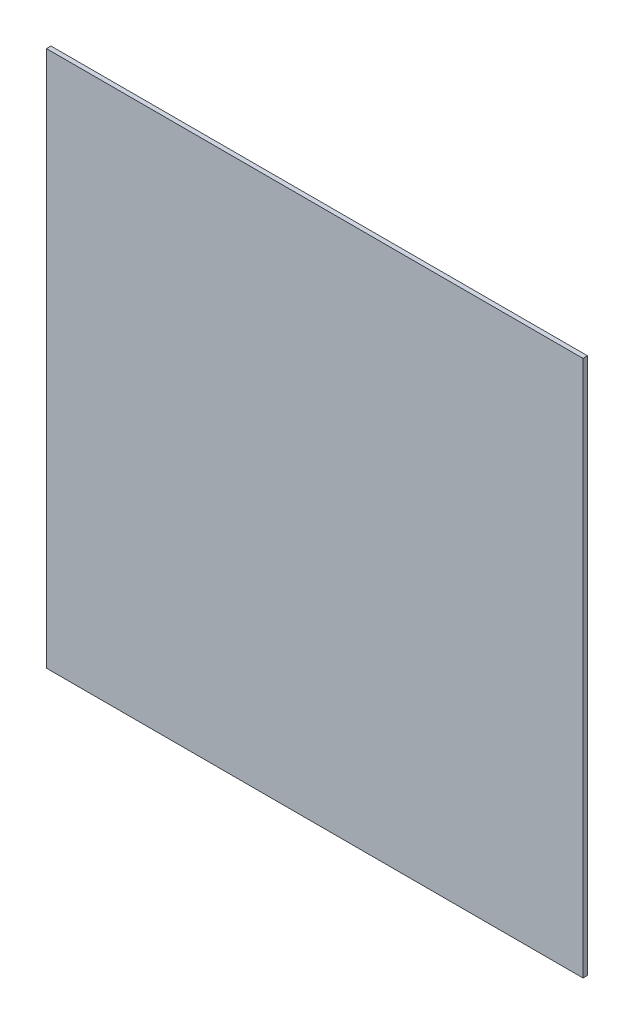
ISO-10303-21;
HEADER;
FILE_DESCRIPTION(('STEP AP214'),'2;1');
FILE_NAME('part.step','',(''),(''),'','','');
FILE_SCHEMA(('AUTOMOTIVE_DESIGN { 1 0 10303 214 1 1 1 1 }'));
ENDSEC;
DATA;
#1=APPLICATION_CONTEXT('core data for automotive mechanical design processes');
#2=APPLICATION_PROTOCOL_DEFINITION('international standard','automotive_design',2000,#1);
#3=PRODUCT_CONTEXT('',#1,'mechanical');
#4=PRODUCT('Part','Part','',(#3));
#5=PRODUCT_RELATED_PRODUCT_CATEGORY('part','',(#4));
#6=PRODUCT_DEFINITION_FORMATION('','',#4);
#7=PRODUCT_DEFINITION_CONTEXT('part definition',#1,'design');
#8=PRODUCT_DEFINITION('design','',#6,#7);
#9=PRODUCT_DEFINITION_SHAPE('','',#8);
#10=(LENGTH_UNIT() NAMED_UNIT(*) SI_UNIT(.MILLI.,.METRE.));
#11=(NAMED_UNIT(*) PLANE_ANGLE_UNIT() SI_UNIT($,.RADIAN.));
#12=(NAMED_UNIT(*) SI_UNIT($,.STERADIAN.) SOLID_ANGLE_UNIT());
#13=UNCERTAINTY_MEASURE_WITH_UNIT(LENGTH_MEASURE(1.E-05),#10,'distance_accuracy_value','');
#14=(GEOMETRIC_REPRESENTATION_CONTEXT(3) GLOBAL_UNCERTAINTY_ASSIGNED_CONTEXT((#13)) GLOBAL_UNIT_ASSIGNED_CONTEXT((#10,
#11,#12)) REPRESENTATION_CONTEXT('',''));
#15=CARTESIAN_POINT('',(0.,0.,0.));
#16=DIRECTION('',(0.,0.,1.));
#17=DIRECTION('',(1.,0.,0.));
#18=AXIS2_PLACEMENT_3D('',#15,#16,#17);
#19=CARTESIAN_POINT('',(290.,-305.,5.));
#20=DIRECTION('',(0.,1.,0.));
#21=DIRECTION('',(0.,0.,1.));
#22=AXIS2_PLACEMENT_3D('',#19,#20,#21);
#23=PLANE('',#22);
#24=DIRECTION('',(1.,0.,0.));
#25=VECTOR('',#24,1.);
#26=CARTESIAN_POINT('',(290.,-305.,0.));
#27=LINE('',#26,#25);
#28=CARTESIAN_POINT('',(-305.,-305.,0.));
#29=VERTEX_POINT('',#28);
#30=CARTESIAN_POINT('',(290.,-305.,0.));
#31=VERTEX_POINT('',#30);
#32=EDGE_CURVE('E97',#29,#31,#27,.T.);
#33=ORIENTED_EDGE('',*,*,#32,.T.);
#34=DIRECTION('',(0.,0.,-1.));
#35=VECTOR('',#34,1.);
#36=CARTESIAN_POINT('',(290.,-305.,5.));
#37=LINE('',#36,#35);
#38=CARTESIAN_POINT('',(290.,-305.,5.));
#39=VERTEX_POINT('',#38);
#40=EDGE_CURVE('E11',#39,#31,#37,.T.);
#41=ORIENTED_EDGE('',*,*,#40,.F.);
#42=DIRECTION('',(1.,0.,0.));
#43=VECTOR('',#42,1.);
#44=CARTESIAN_POINT('',(290.,-305.,5.));
#45=LINE('',#44,#43);
#46=CARTESIAN_POINT('',(-305.,-305.,5.));
#47=VERTEX_POINT('',#46);
#48=EDGE_CURVE('E85',#47,#39,#45,.T.);
#49=ORIENTED_EDGE('',*,*,#48,.F.);
#50=DIRECTION('',(0.,0.,-1.));
#51=VECTOR('',#50,1.);
#52=CARTESIAN_POINT('',(-305.,-305.,5.));
#53=LINE('',#52,#51);
#54=EDGE_CURVE('E93',#47,#29,#53,.T.);
#55=ORIENTED_EDGE('',*,*,#54,.T.);
#56=EDGE_LOOP('',(#33,#41,#49,#55));
#57=FACE_BOUND('',#56,.T.);
#58=ADVANCED_FACE('F34',(#57),#23,.F.);
#59=CARTESIAN_POINT('',(290.,290.,5.));
#60=DIRECTION('',(-1.,0.,0.));
#61=DIRECTION('',(0.,-1.,0.));
#62=AXIS2_PLACEMENT_3D('',#59,#60,#61);
#63=PLANE('',#62);
#64=DIRECTION('',(0.,1.,0.));
#65=VECTOR('',#64,1.);
#66=CARTESIAN_POINT('',(290.,290.,0.));
#67=LINE('',#66,#65);
#68=CARTESIAN_POINT('',(290.,290.,0.));
#69=VERTEX_POINT('',#68);
#70=EDGE_CURVE('E89',#31,#69,#67,.T.);
#71=ORIENTED_EDGE('',*,*,#70,.T.);
#72=DIRECTION('',(0.,0.,-1.));
#73=VECTOR('',#72,1.);
#74=CARTESIAN_POINT('',(290.,290.,5.));
#75=LINE('',#74,#73);
#76=CARTESIAN_POINT('',(290.,290.,5.));
#77=VERTEX_POINT('',#76);
#78=EDGE_CURVE('E42',#77,#69,#75,.T.);
#79=ORIENTED_EDGE('',*,*,#78,.F.);
#80=DIRECTION('',(0.,1.,0.));
#81=VECTOR('',#80,1.);
#82=CARTESIAN_POINT('',(290.,290.,5.));
#83=LINE('',#82,#81);
#84=EDGE_CURVE('E80',#39,#77,#83,.T.);
#85=ORIENTED_EDGE('',*,*,#84,.F.);
#86=ORIENTED_EDGE('',*,*,#40,.T.);
#87=EDGE_LOOP('',(#71,#79,#85,#86));
#88=FACE_BOUND('',#87,.T.);
#89=ADVANCED_FACE('F88',(#88),#63,.F.);
#90=CARTESIAN_POINT('',(-305.,290.,5.));
#91=DIRECTION('',(0.,-1.,0.));
#92=DIRECTION('',(0.,0.,-1.));
#93=AXIS2_PLACEMENT_3D('',#90,#91,#92);
#94=PLANE('',#93);
#95=DIRECTION('',(-1.,0.,0.));
#96=VECTOR('',#95,1.);
#97=CARTESIAN_POINT('',(-305.,290.,0.));
#98=LINE('',#97,#96);
#99=CARTESIAN_POINT('',(-305.,290.,0.));
#100=VERTEX_POINT('',#99);
#101=EDGE_CURVE('E67',#69,#100,#98,.T.);
#102=ORIENTED_EDGE('',*,*,#101,.T.);
#103=DIRECTION('',(0.,0.,-1.));
#104=VECTOR('',#103,1.);
#105=CARTESIAN_POINT('',(-305.,290.,5.));
#106=LINE('',#105,#104);
#107=CARTESIAN_POINT('',(-305.,290.,5.));
#108=VERTEX_POINT('',#107);
#109=EDGE_CURVE('E90',#108,#100,#106,.T.);
#110=ORIENTED_EDGE('',*,*,#109,.F.);
#111=DIRECTION('',(-1.,0.,0.));
#112=VECTOR('',#111,1.);
#113=CARTESIAN_POINT('',(-305.,290.,5.));
#114=LINE('',#113,#112);
#115=EDGE_CURVE('E83',#77,#108,#114,.T.);
#116=ORIENTED_EDGE('',*,*,#115,.F.);
#117=ORIENTED_EDGE('',*,*,#78,.T.);
#118=EDGE_LOOP('',(#102,#110,#116,#117));
#119=FACE_BOUND('',#118,.T.);
#120=ADVANCED_FACE('F91',(#119),#94,.F.);
#121=CARTESIAN_POINT('',(-305.,-305.,5.));
#122=DIRECTION('',(1.,0.,0.));
#123=DIRECTION('',(0.,1.,0.));
#124=AXIS2_PLACEMENT_3D('',#121,#122,#123);
#125=PLANE('',#124);
#126=DIRECTION('',(0.,-1.,0.));
#127=VECTOR('',#126,1.);
#128=CARTESIAN_POINT('',(-305.,-305.,0.));
#129=LINE('',#128,#127);
#130=EDGE_CURVE('E73',#100,#29,#129,.T.);
#131=ORIENTED_EDGE('',*,*,#130,.T.);
#132=ORIENTED_EDGE('',*,*,#54,.F.);
#133=DIRECTION('',(0.,-1.,0.));
#134=VECTOR('',#133,1.);
#135=CARTESIAN_POINT('',(-305.,-305.,5.));
#136=LINE('',#135,#134);
#137=EDGE_CURVE('E50',#108,#47,#136,.T.);
#138=ORIENTED_EDGE('',*,*,#137,.F.);
#139=ORIENTED_EDGE('',*,*,#109,.T.);
#140=EDGE_LOOP('',(#131,#132,#138,#139));
#141=FACE_BOUND('',#140,.T.);
#142=ADVANCED_FACE('F104',(#141),#125,.F.);
#143=CARTESIAN_POINT('',(0.,0.,5.));
#144=DIRECTION('',(0.,0.,-1.));
#145=DIRECTION('',(-1.,0.,0.));
#146=AXIS2_PLACEMENT_3D('',#143,#144,#145);
#147=PLANE('',#146);
#148=ORIENTED_EDGE('',*,*,#48,.T.);
#149=ORIENTED_EDGE('',*,*,#84,.T.);
#150=ORIENTED_EDGE('',*,*,#115,.T.);
#151=ORIENTED_EDGE('',*,*,#137,.T.);
#152=EDGE_LOOP('',(#148,#149,#150,#151));
#153=FACE_BOUND('',#152,.T.);
#154=ADVANCED_FACE('F81',(#153),#147,.F.);
#155=CARTESIAN_POINT('',(0.,0.,0.));
#156=DIRECTION('',(0.,0.,-1.));
#157=DIRECTION('',(-1.,0.,0.));
#158=AXIS2_PLACEMENT_3D('',#155,#156,#157);
#159=PLANE('',#158);
#160=ORIENTED_EDGE('',*,*,#32,.F.);
#161=ORIENTED_EDGE('',*,*,#130,.F.);
#162=ORIENTED_EDGE('',*,*,#101,.F.);
#163=ORIENTED_EDGE('',*,*,#70,.F.);
#164=EDGE_LOOP('',(#160,#161,#162,#163));
#165=FACE_BOUND('',#164,.T.);
#166=ADVANCED_FACE('F107',(#165),#159,.T.);
#167=CLOSED_SHELL('',(#58,#89,#120,#142,#154,#166));
#168=MANIFOLD_SOLID_BREP('B2',#167);
#169=ADVANCED_BREP_SHAPE_REPRESENTATION('',(#18,#168),#14);
#170=SHAPE_DEFINITION_REPRESENTATION(#9,#169);
ENDSEC;
END-ISO-10303-21;
